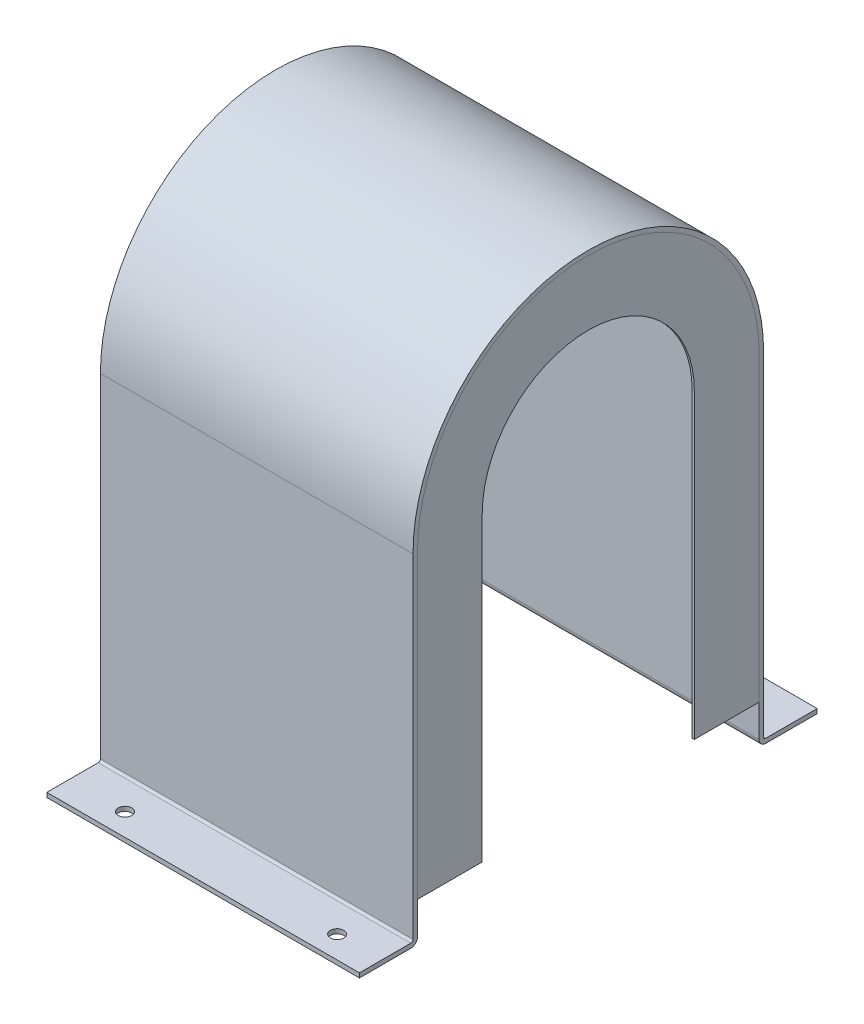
ISO-10303-21;
HEADER;
FILE_DESCRIPTION(('STEP AP214'),'2;1');
FILE_NAME('part.step','',(''),(''),'','','');
FILE_SCHEMA(('AUTOMOTIVE_DESIGN { 1 0 10303 214 1 1 1 1 }'));
ENDSEC;
DATA;
#1=APPLICATION_CONTEXT('core data for automotive mechanical design processes');
#2=APPLICATION_PROTOCOL_DEFINITION('international standard','automotive_design',2000,#1);
#3=PRODUCT_CONTEXT('',#1,'mechanical');
#4=PRODUCT('Part','Part','',(#3));
#5=PRODUCT_RELATED_PRODUCT_CATEGORY('part','',(#4));
#6=PRODUCT_DEFINITION_FORMATION('','',#4);
#7=PRODUCT_DEFINITION_CONTEXT('part definition',#1,'design');
#8=PRODUCT_DEFINITION('design','',#6,#7);
#9=PRODUCT_DEFINITION_SHAPE('','',#8);
#10=(LENGTH_UNIT() NAMED_UNIT(*) SI_UNIT(.MILLI.,.METRE.));
#11=(NAMED_UNIT(*) PLANE_ANGLE_UNIT() SI_UNIT($,.RADIAN.));
#12=(NAMED_UNIT(*) SI_UNIT($,.STERADIAN.) SOLID_ANGLE_UNIT());
#13=UNCERTAINTY_MEASURE_WITH_UNIT(LENGTH_MEASURE(1.E-05),#10,'distance_accuracy_value','');
#14=(GEOMETRIC_REPRESENTATION_CONTEXT(3) GLOBAL_UNCERTAINTY_ASSIGNED_CONTEXT((#13)) GLOBAL_UNIT_ASSIGNED_CONTEXT((#10,
#11,#12)) REPRESENTATION_CONTEXT('',''));
#15=CARTESIAN_POINT('',(0.,0.,0.));
#16=DIRECTION('',(0.,0.,1.));
#17=DIRECTION('',(1.,0.,0.));
#18=AXIS2_PLACEMENT_3D('',#15,#16,#17);
#19=CARTESIAN_POINT('',(-138.,-270.,153.));
#20=DIRECTION('',(0.,-1.,0.));
#21=DIRECTION('',(0.,0.,-1.));
#22=AXIS2_PLACEMENT_3D('',#19,#20,#21);
#23=PLANE('',#22);
#24=DIRECTION('',(-1.,0.,0.));
#25=VECTOR('',#24,1.);
#26=CARTESIAN_POINT('',(140.,-270.,95.));
#27=LINE('',#26,#25);
#28=CARTESIAN_POINT('',(-138.,-270.,95.));
#29=VERTEX_POINT('',#28);
#30=CARTESIAN_POINT('',(-140.,-270.,95.));
#31=VERTEX_POINT('',#30);
#32=EDGE_CURVE('E186',#29,#31,#27,.T.);
#33=ORIENTED_EDGE('',*,*,#32,.F.);
#34=DIRECTION('',(0.,0.,-1.));
#35=VECTOR('',#34,1.);
#36=CARTESIAN_POINT('',(-138.,-270.,153.));
#37=LINE('',#36,#35);
#38=CARTESIAN_POINT('',(-138.,-270.,153.));
#39=VERTEX_POINT('',#38);
#40=EDGE_CURVE('E150',#39,#29,#37,.T.);
#41=ORIENTED_EDGE('',*,*,#40,.F.);
#42=DIRECTION('',(-1.,0.,0.));
#43=VECTOR('',#42,1.);
#44=CARTESIAN_POINT('',(-138.,-270.,153.));
#45=LINE('',#44,#43);
#46=CARTESIAN_POINT('',(-140.,-270.,153.));
#47=VERTEX_POINT('',#46);
#48=EDGE_CURVE('E158',#39,#47,#45,.T.);
#49=ORIENTED_EDGE('',*,*,#48,.T.);
#50=DIRECTION('',(0.,0.,-1.));
#51=VECTOR('',#50,1.);
#52=CARTESIAN_POINT('',(-140.,-270.,153.));
#53=LINE('',#52,#51);
#54=EDGE_CURVE('E161',#47,#31,#53,.T.);
#55=ORIENTED_EDGE('',*,*,#54,.T.);
#56=EDGE_LOOP('',(#33,#41,#49,#55));
#57=FACE_BOUND('',#56,.T.);
#58=ADVANCED_FACE('F59',(#57),#23,.T.);
#59=CARTESIAN_POINT('',(-138.,0.,0.));
#60=DIRECTION('',(-1.,0.,0.));
#61=DIRECTION('',(0.,0.,-1.));
#62=AXIS2_PLACEMENT_3D('',#59,#60,#61);
#63=CYLINDRICAL_SURFACE('',#62,95.);
#64=DIRECTION('',(-1.,0.,0.));
#65=VECTOR('',#64,1.);
#66=CARTESIAN_POINT('',(-138.,0.,95.));
#67=LINE('',#66,#65);
#68=CARTESIAN_POINT('',(-140.,0.,95.));
#69=VERTEX_POINT('',#68);
#70=CARTESIAN_POINT('',(-138.,0.,95.));
#71=VERTEX_POINT('',#70);
#72=EDGE_CURVE('E13',#69,#71,#67,.F.);
#73=ORIENTED_EDGE('',*,*,#72,.F.);
#74=CARTESIAN_POINT('',(-140.,0.,0.));
#75=DIRECTION('',(1.,0.,0.));
#76=DIRECTION('',(0.,0.,-1.));
#77=AXIS2_PLACEMENT_3D('',#74,#75,#76);
#78=CIRCLE('',#77,95.);
#79=CARTESIAN_POINT('',(-140.,0.,-95.));
#80=VERTEX_POINT('',#79);
#81=EDGE_CURVE('E133',#80,#69,#78,.T.);
#82=ORIENTED_EDGE('',*,*,#81,.F.);
#83=DIRECTION('',(-1.,0.,0.));
#84=VECTOR('',#83,1.);
#85=CARTESIAN_POINT('',(-138.,0.,-95.));
#86=LINE('',#85,#84);
#87=CARTESIAN_POINT('',(-138.,0.,-95.));
#88=VERTEX_POINT('',#87);
#89=EDGE_CURVE('E67',#80,#88,#86,.F.);
#90=ORIENTED_EDGE('',*,*,#89,.T.);
#91=CARTESIAN_POINT('',(-138.,0.,0.));
#92=DIRECTION('',(1.,0.,0.));
#93=DIRECTION('',(0.,0.,-1.));
#94=AXIS2_PLACEMENT_3D('',#91,#92,#93);
#95=CIRCLE('',#94,95.);
#96=EDGE_CURVE('E138',#88,#71,#95,.T.);
#97=ORIENTED_EDGE('',*,*,#96,.T.);
#98=EDGE_LOOP('',(#73,#82,#90,#97));
#99=FACE_BOUND('',#98,.T.);
#100=ADVANCED_FACE('F137',(#99),#63,.F.);
#101=CARTESIAN_POINT('',(-138.,0.,153.));
#102=DIRECTION('',(0.,0.,1.));
#103=DIRECTION('',(-1.,0.,0.));
#104=AXIS2_PLACEMENT_3D('',#101,#102,#103);
#105=PLANE('',#104);
#106=DIRECTION('',(0.,-1.,0.));
#107=VECTOR('',#106,1.);
#108=CARTESIAN_POINT('',(-140.,0.,153.));
#109=LINE('',#108,#107);
#110=CARTESIAN_POINT('',(-140.,0.,153.));
#111=VERTEX_POINT('',#110);
#112=EDGE_CURVE('E141',#111,#47,#109,.T.);
#113=ORIENTED_EDGE('',*,*,#112,.T.);
#114=ORIENTED_EDGE('',*,*,#48,.F.);
#115=DIRECTION('',(0.,-1.,0.));
#116=VECTOR('',#115,1.);
#117=CARTESIAN_POINT('',(-138.,0.,153.));
#118=LINE('',#117,#116);
#119=CARTESIAN_POINT('',(-138.,0.,153.));
#120=VERTEX_POINT('',#119);
#121=EDGE_CURVE('E145',#120,#39,#118,.T.);
#122=ORIENTED_EDGE('',*,*,#121,.F.);
#123=DIRECTION('',(-1.,0.,0.));
#124=VECTOR('',#123,1.);
#125=CARTESIAN_POINT('',(-138.,0.,153.));
#126=LINE('',#125,#124);
#127=EDGE_CURVE('E128',#120,#111,#126,.T.);
#128=ORIENTED_EDGE('',*,*,#127,.T.);
#129=EDGE_LOOP('',(#113,#114,#122,#128));
#130=FACE_BOUND('',#129,.T.);
#131=ADVANCED_FACE('F61',(#130),#105,.T.);
#132=CARTESIAN_POINT('',(-138.,0.,0.));
#133=DIRECTION('',(-1.,0.,0.));
#134=DIRECTION('',(0.,0.,-1.));
#135=AXIS2_PLACEMENT_3D('',#132,#133,#134);
#136=CYLINDRICAL_SURFACE('',#135,153.);
#137=CARTESIAN_POINT('',(-140.,0.,0.));
#138=DIRECTION('',(-1.,0.,0.));
#139=DIRECTION('',(0.,0.,1.));
#140=AXIS2_PLACEMENT_3D('',#137,#138,#139);
#141=CIRCLE('',#140,153.);
#142=CARTESIAN_POINT('',(-140.,0.,-153.));
#143=VERTEX_POINT('',#142);
#144=EDGE_CURVE('E149',#111,#143,#141,.T.);
#145=ORIENTED_EDGE('',*,*,#144,.F.);
#146=ORIENTED_EDGE('',*,*,#127,.F.);
#147=CARTESIAN_POINT('',(-138.,0.,0.));
#148=DIRECTION('',(-1.,0.,0.));
#149=DIRECTION('',(0.,0.,1.));
#150=AXIS2_PLACEMENT_3D('',#147,#148,#149);
#151=CIRCLE('',#150,153.);
#152=CARTESIAN_POINT('',(-138.,0.,-153.));
#153=VERTEX_POINT('',#152);
#154=EDGE_CURVE('E155',#120,#153,#151,.T.);
#155=ORIENTED_EDGE('',*,*,#154,.T.);
#156=DIRECTION('',(-1.,0.,0.));
#157=VECTOR('',#156,1.);
#158=CARTESIAN_POINT('',(-138.,0.,-153.));
#159=LINE('',#158,#157);
#160=EDGE_CURVE('E170',#153,#143,#159,.T.);
#161=ORIENTED_EDGE('',*,*,#160,.T.);
#162=EDGE_LOOP('',(#145,#146,#155,#161));
#163=FACE_BOUND('',#162,.T.);
#164=ADVANCED_FACE('F197',(#163),#136,.T.);
#165=CARTESIAN_POINT('',(-138.,-270.,-153.));
#166=DIRECTION('',(0.,0.,-1.));
#167=DIRECTION('',(0.,1.,0.));
#168=AXIS2_PLACEMENT_3D('',#165,#166,#167);
#169=PLANE('',#168);
#170=DIRECTION('',(0.,1.,0.));
#171=VECTOR('',#170,1.);
#172=CARTESIAN_POINT('',(-140.,-270.,-153.));
#173=LINE('',#172,#171);
#174=CARTESIAN_POINT('',(-140.,-270.,-153.));
#175=VERTEX_POINT('',#174);
#176=EDGE_CURVE('E164',#175,#143,#173,.T.);
#177=ORIENTED_EDGE('',*,*,#176,.T.);
#178=ORIENTED_EDGE('',*,*,#160,.F.);
#179=DIRECTION('',(0.,1.,0.));
#180=VECTOR('',#179,1.);
#181=CARTESIAN_POINT('',(-138.,-270.,-153.));
#182=LINE('',#181,#180);
#183=CARTESIAN_POINT('',(-138.,-270.,-153.));
#184=VERTEX_POINT('',#183);
#185=EDGE_CURVE('E153',#184,#153,#182,.T.);
#186=ORIENTED_EDGE('',*,*,#185,.F.);
#187=DIRECTION('',(-1.,0.,0.));
#188=VECTOR('',#187,1.);
#189=CARTESIAN_POINT('',(-138.,-270.,-153.));
#190=LINE('',#189,#188);
#191=EDGE_CURVE('E173',#184,#175,#190,.T.);
#192=ORIENTED_EDGE('',*,*,#191,.T.);
#193=EDGE_LOOP('',(#177,#178,#186,#192));
#194=FACE_BOUND('',#193,.T.);
#195=ADVANCED_FACE('F199',(#194),#169,.T.);
#196=DIRECTION('',(-1.,0.,0.));
#197=VECTOR('',#196,1.);
#198=CARTESIAN_POINT('',(140.,-270.,-95.));
#199=LINE('',#198,#197);
#200=CARTESIAN_POINT('',(-138.,-270.,-95.));
#201=VERTEX_POINT('',#200);
#202=CARTESIAN_POINT('',(-140.,-270.,-95.));
#203=VERTEX_POINT('',#202);
#204=EDGE_CURVE('E184',#201,#203,#199,.T.);
#205=ORIENTED_EDGE('',*,*,#204,.T.);
#206=EDGE_CURVE('E135',#203,#175,#53,.T.);
#207=ORIENTED_EDGE('',*,*,#206,.T.);
#208=ORIENTED_EDGE('',*,*,#191,.F.);
#209=EDGE_CURVE('E148',#201,#184,#37,.T.);
#210=ORIENTED_EDGE('',*,*,#209,.F.);
#211=EDGE_LOOP('',(#205,#207,#208,#210));
#212=FACE_BOUND('',#211,.T.);
#213=ADVANCED_FACE('F203',(#212),#23,.T.);
#214=CARTESIAN_POINT('',(-138.,0.,0.));
#215=DIRECTION('',(1.,0.,0.));
#216=DIRECTION('',(0.,0.,1.));
#217=AXIS2_PLACEMENT_3D('',#214,#215,#216);
#218=PLANE('',#217);
#219=DIRECTION('',(0.,-1.,0.));
#220=VECTOR('',#219,1.);
#221=CARTESIAN_POINT('',(-138.,0.,95.));
#222=LINE('',#221,#220);
#223=EDGE_CURVE('E139',#71,#29,#222,.T.);
#224=ORIENTED_EDGE('',*,*,#223,.F.);
#225=ORIENTED_EDGE('',*,*,#96,.F.);
#226=DIRECTION('',(0.,1.,0.));
#227=VECTOR('',#226,1.);
#228=CARTESIAN_POINT('',(-138.,0.,-95.));
#229=LINE('',#228,#227);
#230=EDGE_CURVE('E81',#201,#88,#229,.T.);
#231=ORIENTED_EDGE('',*,*,#230,.F.);
#232=ORIENTED_EDGE('',*,*,#209,.T.);
#233=ORIENTED_EDGE('',*,*,#185,.T.);
#234=ORIENTED_EDGE('',*,*,#154,.F.);
#235=ORIENTED_EDGE('',*,*,#121,.T.);
#236=ORIENTED_EDGE('',*,*,#40,.T.);
#237=EDGE_LOOP('',(#224,#225,#231,#232,#233,#234,#235,#236));
#238=FACE_BOUND('',#237,.T.);
#239=ADVANCED_FACE('F193',(#238),#218,.T.);
#240=CARTESIAN_POINT('',(-140.,0.,0.));
#241=DIRECTION('',(1.,0.,0.));
#242=DIRECTION('',(0.,0.,1.));
#243=AXIS2_PLACEMENT_3D('',#240,#241,#242);
#244=PLANE('',#243);
#245=ORIENTED_EDGE('',*,*,#81,.T.);
#246=DIRECTION('',(0.,1.,0.));
#247=VECTOR('',#246,1.);
#248=CARTESIAN_POINT('',(-140.,0.,95.));
#249=LINE('',#248,#247);
#250=EDGE_CURVE('E73',#31,#69,#249,.T.);
#251=ORIENTED_EDGE('',*,*,#250,.F.);
#252=ORIENTED_EDGE('',*,*,#54,.F.);
#253=ORIENTED_EDGE('',*,*,#112,.F.);
#254=ORIENTED_EDGE('',*,*,#144,.T.);
#255=ORIENTED_EDGE('',*,*,#176,.F.);
#256=ORIENTED_EDGE('',*,*,#206,.F.);
#257=DIRECTION('',(0.,-1.,0.));
#258=VECTOR('',#257,1.);
#259=CARTESIAN_POINT('',(-140.,-270.,-95.));
#260=LINE('',#259,#258);
#261=EDGE_CURVE('E122',#80,#203,#260,.T.);
#262=ORIENTED_EDGE('',*,*,#261,.F.);
#263=EDGE_LOOP('',(#245,#251,#252,#253,#254,#255,#256,#262));
#264=FACE_BOUND('',#263,.T.);
#265=ADVANCED_FACE('F132',(#264),#244,.F.);
#266=CARTESIAN_POINT('',(140.,-270.,-95.));
#267=DIRECTION('',(0.,0.,-1.));
#268=DIRECTION('',(-1.,0.,0.));
#269=AXIS2_PLACEMENT_3D('',#266,#267,#268);
#270=PLANE('',#269);
#271=ORIENTED_EDGE('',*,*,#230,.T.);
#272=ORIENTED_EDGE('',*,*,#89,.F.);
#273=ORIENTED_EDGE('',*,*,#261,.T.);
#274=ORIENTED_EDGE('',*,*,#204,.F.);
#275=EDGE_LOOP('',(#271,#272,#273,#274));
#276=FACE_BOUND('',#275,.T.);
#277=ADVANCED_FACE('F121',(#276),#270,.F.);
#278=CARTESIAN_POINT('',(140.,0.,95.));
#279=DIRECTION('',(0.,0.,1.));
#280=DIRECTION('',(1.,0.,0.));
#281=AXIS2_PLACEMENT_3D('',#278,#279,#280);
#282=PLANE('',#281);
#283=ORIENTED_EDGE('',*,*,#223,.T.);
#284=ORIENTED_EDGE('',*,*,#32,.T.);
#285=ORIENTED_EDGE('',*,*,#250,.T.);
#286=ORIENTED_EDGE('',*,*,#72,.T.);
#287=EDGE_LOOP('',(#283,#284,#285,#286));
#288=FACE_BOUND('',#287,.T.);
#289=ADVANCED_FACE('F190',(#288),#282,.F.);
#290=CLOSED_SHELL('',(#58,#100,#131,#164,#195,#213,#239,#265,#277,#289));
#291=MANIFOLD_SOLID_BREP('B2',#290);
#292=CARTESIAN_POINT('',(138.,-270.,153.));
#293=DIRECTION('',(0.,-1.,0.));
#294=DIRECTION('',(0.,0.,-1.));
#295=AXIS2_PLACEMENT_3D('',#292,#293,#294);
#296=PLANE('',#295);
#297=DIRECTION('',(-1.,0.,0.));
#298=VECTOR('',#297,1.);
#299=CARTESIAN_POINT('',(140.,-270.,95.));
#300=LINE('',#299,#298);
#301=CARTESIAN_POINT('',(140.,-270.,95.));
#302=VERTEX_POINT('',#301);
#303=CARTESIAN_POINT('',(138.,-270.,95.));
#304=VERTEX_POINT('',#303);
#305=EDGE_CURVE('E364',#302,#304,#300,.T.);
#306=ORIENTED_EDGE('',*,*,#305,.F.);
#307=DIRECTION('',(0.,0.,-1.));
#308=VECTOR('',#307,1.);
#309=CARTESIAN_POINT('',(140.,-270.,153.));
#310=LINE('',#309,#308);
#311=CARTESIAN_POINT('',(140.,-270.,153.));
#312=VERTEX_POINT('',#311);
#313=EDGE_CURVE('E383',#312,#302,#310,.T.);
#314=ORIENTED_EDGE('',*,*,#313,.F.);
#315=DIRECTION('',(1.,0.,0.));
#316=VECTOR('',#315,1.);
#317=CARTESIAN_POINT('',(138.,-270.,153.));
#318=LINE('',#317,#316);
#319=CARTESIAN_POINT('',(138.,-270.,153.));
#320=VERTEX_POINT('',#319);
#321=EDGE_CURVE('E297',#320,#312,#318,.T.);
#322=ORIENTED_EDGE('',*,*,#321,.F.);
#323=DIRECTION('',(0.,0.,-1.));
#324=VECTOR('',#323,1.);
#325=CARTESIAN_POINT('',(138.,-270.,153.));
#326=LINE('',#325,#324);
#327=EDGE_CURVE('E409',#320,#304,#326,.T.);
#328=ORIENTED_EDGE('',*,*,#327,.T.);
#329=EDGE_LOOP('',(#306,#314,#322,#328));
#330=FACE_BOUND('',#329,.T.);
#331=ADVANCED_FACE('F293',(#330),#296,.T.);
#332=CARTESIAN_POINT('',(138.,0.,153.));
#333=DIRECTION('',(0.,0.,1.));
#334=DIRECTION('',(1.,0.,0.));
#335=AXIS2_PLACEMENT_3D('',#332,#333,#334);
#336=PLANE('',#335);
#337=DIRECTION('',(0.,-1.,0.));
#338=VECTOR('',#337,1.);
#339=CARTESIAN_POINT('',(140.,0.,153.));
#340=LINE('',#339,#338);
#341=CARTESIAN_POINT('',(140.,0.,153.));
#342=VERTEX_POINT('',#341);
#343=EDGE_CURVE('E384',#342,#312,#340,.T.);
#344=ORIENTED_EDGE('',*,*,#343,.F.);
#345=DIRECTION('',(1.,0.,0.));
#346=VECTOR('',#345,1.);
#347=CARTESIAN_POINT('',(138.,0.,153.));
#348=LINE('',#347,#346);
#349=CARTESIAN_POINT('',(138.,0.,153.));
#350=VERTEX_POINT('',#349);
#351=EDGE_CURVE('E57',#350,#342,#348,.T.);
#352=ORIENTED_EDGE('',*,*,#351,.F.);
#353=DIRECTION('',(0.,-1.,0.));
#354=VECTOR('',#353,1.);
#355=CARTESIAN_POINT('',(138.,0.,153.));
#356=LINE('',#355,#354);
#357=EDGE_CURVE('E395',#350,#320,#356,.T.);
#358=ORIENTED_EDGE('',*,*,#357,.T.);
#359=ORIENTED_EDGE('',*,*,#321,.T.);
#360=EDGE_LOOP('',(#344,#352,#358,#359));
#361=FACE_BOUND('',#360,.T.);
#362=ADVANCED_FACE('F295',(#361),#336,.T.);
#363=CARTESIAN_POINT('',(138.,0.,0.));
#364=DIRECTION('',(1.,0.,0.));
#365=DIRECTION('',(0.,0.,-1.));
#366=AXIS2_PLACEMENT_3D('',#363,#364,#365);
#367=CYLINDRICAL_SURFACE('',#366,153.);
#368=CARTESIAN_POINT('',(140.,0.,0.));
#369=DIRECTION('',(-1.,0.,0.));
#370=DIRECTION('',(0.,0.,1.));
#371=AXIS2_PLACEMENT_3D('',#368,#369,#370);
#372=CIRCLE('',#371,153.);
#373=CARTESIAN_POINT('',(140.,0.,-153.));
#374=VERTEX_POINT('',#373);
#375=EDGE_CURVE('E393',#342,#374,#372,.T.);
#376=ORIENTED_EDGE('',*,*,#375,.T.);
#377=DIRECTION('',(1.,0.,0.));
#378=VECTOR('',#377,1.);
#379=CARTESIAN_POINT('',(138.,0.,-153.));
#380=LINE('',#379,#378);
#381=CARTESIAN_POINT('',(138.,0.,-153.));
#382=VERTEX_POINT('',#381);
#383=EDGE_CURVE('E302',#382,#374,#380,.T.);
#384=ORIENTED_EDGE('',*,*,#383,.F.);
#385=CARTESIAN_POINT('',(138.,0.,0.));
#386=DIRECTION('',(-1.,0.,0.));
#387=DIRECTION('',(0.,0.,1.));
#388=AXIS2_PLACEMENT_3D('',#385,#386,#387);
#389=CIRCLE('',#388,153.);
#390=EDGE_CURVE('E397',#350,#382,#389,.T.);
#391=ORIENTED_EDGE('',*,*,#390,.F.);
#392=ORIENTED_EDGE('',*,*,#351,.T.);
#393=EDGE_LOOP('',(#376,#384,#391,#392));
#394=FACE_BOUND('',#393,.T.);
#395=ADVANCED_FACE('F434',(#394),#367,.T.);
#396=CARTESIAN_POINT('',(138.,-270.,-153.));
#397=DIRECTION('',(0.,0.,-1.));
#398=DIRECTION('',(0.,1.,0.));
#399=AXIS2_PLACEMENT_3D('',#396,#397,#398);
#400=PLANE('',#399);
#401=DIRECTION('',(0.,1.,0.));
#402=VECTOR('',#401,1.);
#403=CARTESIAN_POINT('',(140.,-270.,-153.));
#404=LINE('',#403,#402);
#405=CARTESIAN_POINT('',(140.,-270.,-153.));
#406=VERTEX_POINT('',#405);
#407=EDGE_CURVE('E386',#406,#374,#404,.T.);
#408=ORIENTED_EDGE('',*,*,#407,.F.);
#409=DIRECTION('',(1.,0.,0.));
#410=VECTOR('',#409,1.);
#411=CARTESIAN_POINT('',(138.,-270.,-153.));
#412=LINE('',#411,#410);
#413=CARTESIAN_POINT('',(138.,-270.,-153.));
#414=VERTEX_POINT('',#413);
#415=EDGE_CURVE('E381',#414,#406,#412,.T.);
#416=ORIENTED_EDGE('',*,*,#415,.F.);
#417=DIRECTION('',(0.,1.,0.));
#418=VECTOR('',#417,1.);
#419=CARTESIAN_POINT('',(138.,-270.,-153.));
#420=LINE('',#419,#418);
#421=EDGE_CURVE('E402',#414,#382,#420,.T.);
#422=ORIENTED_EDGE('',*,*,#421,.T.);
#423=ORIENTED_EDGE('',*,*,#383,.T.);
#424=EDGE_LOOP('',(#408,#416,#422,#423));
#425=FACE_BOUND('',#424,.T.);
#426=ADVANCED_FACE('F431',(#425),#400,.T.);
#427=DIRECTION('',(-1.,0.,0.));
#428=VECTOR('',#427,1.);
#429=CARTESIAN_POINT('',(140.,-270.,-95.));
#430=LINE('',#429,#428);
#431=CARTESIAN_POINT('',(140.,-270.,-95.));
#432=VERTEX_POINT('',#431);
#433=CARTESIAN_POINT('',(138.,-270.,-95.));
#434=VERTEX_POINT('',#433);
#435=EDGE_CURVE('E357',#432,#434,#430,.T.);
#436=ORIENTED_EDGE('',*,*,#435,.T.);
#437=EDGE_CURVE('E414',#434,#414,#326,.T.);
#438=ORIENTED_EDGE('',*,*,#437,.T.);
#439=ORIENTED_EDGE('',*,*,#415,.T.);
#440=EDGE_CURVE('E372',#432,#406,#310,.T.);
#441=ORIENTED_EDGE('',*,*,#440,.F.);
#442=EDGE_LOOP('',(#436,#438,#439,#441));
#443=FACE_BOUND('',#442,.T.);
#444=ADVANCED_FACE('F379',(#443),#296,.T.);
#445=CARTESIAN_POINT('',(138.,0.,0.));
#446=DIRECTION('',(-1.,0.,0.));
#447=DIRECTION('',(0.,0.,1.));
#448=AXIS2_PLACEMENT_3D('',#445,#446,#447);
#449=PLANE('',#448);
#450=DIRECTION('',(0.,1.,0.));
#451=VECTOR('',#450,1.);
#452=CARTESIAN_POINT('',(138.,0.,95.));
#453=LINE('',#452,#451);
#454=CARTESIAN_POINT('',(138.,0.,95.));
#455=VERTEX_POINT('',#454);
#456=EDGE_CURVE('E318',#304,#455,#453,.T.);
#457=ORIENTED_EDGE('',*,*,#456,.F.);
#458=ORIENTED_EDGE('',*,*,#327,.F.);
#459=ORIENTED_EDGE('',*,*,#357,.F.);
#460=ORIENTED_EDGE('',*,*,#390,.T.);
#461=ORIENTED_EDGE('',*,*,#421,.F.);
#462=ORIENTED_EDGE('',*,*,#437,.F.);
#463=DIRECTION('',(0.,-1.,0.));
#464=VECTOR('',#463,1.);
#465=CARTESIAN_POINT('',(138.,0.,-95.));
#466=LINE('',#465,#464);
#467=CARTESIAN_POINT('',(138.,0.,-95.));
#468=VERTEX_POINT('',#467);
#469=EDGE_CURVE('E360',#468,#434,#466,.T.);
#470=ORIENTED_EDGE('',*,*,#469,.F.);
#471=CARTESIAN_POINT('',(138.,0.,0.));
#472=DIRECTION('',(1.,0.,0.));
#473=DIRECTION('',(0.,0.,-1.));
#474=AXIS2_PLACEMENT_3D('',#471,#472,#473);
#475=CIRCLE('',#474,95.);
#476=EDGE_CURVE('E388',#468,#455,#475,.T.);
#477=ORIENTED_EDGE('',*,*,#476,.T.);
#478=EDGE_LOOP('',(#457,#458,#459,#460,#461,#462,#470,#477));
#479=FACE_BOUND('',#478,.T.);
#480=ADVANCED_FACE('F429',(#479),#449,.T.);
#481=CARTESIAN_POINT('',(140.,0.,0.));
#482=DIRECTION('',(-1.,0.,0.));
#483=DIRECTION('',(0.,0.,1.));
#484=AXIS2_PLACEMENT_3D('',#481,#482,#483);
#485=PLANE('',#484);
#486=ORIENTED_EDGE('',*,*,#313,.T.);
#487=DIRECTION('',(0.,1.,0.));
#488=VECTOR('',#487,1.);
#489=CARTESIAN_POINT('',(140.,0.,95.));
#490=LINE('',#489,#488);
#491=CARTESIAN_POINT('',(140.,0.,95.));
#492=VERTEX_POINT('',#491);
#493=EDGE_CURVE('E377',#302,#492,#490,.T.);
#494=ORIENTED_EDGE('',*,*,#493,.T.);
#495=CARTESIAN_POINT('',(140.,0.,0.));
#496=DIRECTION('',(1.,0.,0.));
#497=DIRECTION('',(0.,0.,-1.));
#498=AXIS2_PLACEMENT_3D('',#495,#496,#497);
#499=CIRCLE('',#498,95.);
#500=CARTESIAN_POINT('',(140.,0.,-95.));
#501=VERTEX_POINT('',#500);
#502=EDGE_CURVE('E376',#501,#492,#499,.T.);
#503=ORIENTED_EDGE('',*,*,#502,.F.);
#504=DIRECTION('',(0.,-1.,0.));
#505=VECTOR('',#504,1.);
#506=CARTESIAN_POINT('',(140.,-270.,-95.));
#507=LINE('',#506,#505);
#508=EDGE_CURVE('E310',#501,#432,#507,.T.);
#509=ORIENTED_EDGE('',*,*,#508,.T.);
#510=ORIENTED_EDGE('',*,*,#440,.T.);
#511=ORIENTED_EDGE('',*,*,#407,.T.);
#512=ORIENTED_EDGE('',*,*,#375,.F.);
#513=ORIENTED_EDGE('',*,*,#343,.T.);
#514=EDGE_LOOP('',(#486,#494,#503,#509,#510,#511,#512,#513));
#515=FACE_BOUND('',#514,.T.);
#516=ADVANCED_FACE('F370',(#515),#485,.F.);
#517=CARTESIAN_POINT('',(138.,0.,0.));
#518=DIRECTION('',(1.,0.,0.));
#519=DIRECTION('',(0.,0.,-1.));
#520=AXIS2_PLACEMENT_3D('',#517,#518,#519);
#521=CYLINDRICAL_SURFACE('',#520,95.);
#522=ORIENTED_EDGE('',*,*,#502,.T.);
#523=DIRECTION('',(-1.,0.,0.));
#524=VECTOR('',#523,1.);
#525=CARTESIAN_POINT('',(140.,0.,95.));
#526=LINE('',#525,#524);
#527=EDGE_CURVE('E421',#492,#455,#526,.T.);
#528=ORIENTED_EDGE('',*,*,#527,.T.);
#529=ORIENTED_EDGE('',*,*,#476,.F.);
#530=DIRECTION('',(-1.,0.,0.));
#531=VECTOR('',#530,1.);
#532=CARTESIAN_POINT('',(140.,0.,-95.));
#533=LINE('',#532,#531);
#534=EDGE_CURVE('E365',#501,#468,#533,.T.);
#535=ORIENTED_EDGE('',*,*,#534,.F.);
#536=EDGE_LOOP('',(#522,#528,#529,#535));
#537=FACE_BOUND('',#536,.T.);
#538=ADVANCED_FACE('F427',(#537),#521,.F.);
#539=CARTESIAN_POINT('',(140.,-270.,-95.));
#540=DIRECTION('',(0.,0.,-1.));
#541=DIRECTION('',(-1.,0.,0.));
#542=AXIS2_PLACEMENT_3D('',#539,#540,#541);
#543=PLANE('',#542);
#544=ORIENTED_EDGE('',*,*,#469,.T.);
#545=ORIENTED_EDGE('',*,*,#435,.F.);
#546=ORIENTED_EDGE('',*,*,#508,.F.);
#547=ORIENTED_EDGE('',*,*,#534,.T.);
#548=EDGE_LOOP('',(#544,#545,#546,#547));
#549=FACE_BOUND('',#548,.T.);
#550=ADVANCED_FACE('F358',(#549),#543,.F.);
#551=CARTESIAN_POINT('',(140.,0.,95.));
#552=DIRECTION('',(0.,0.,1.));
#553=DIRECTION('',(1.,0.,0.));
#554=AXIS2_PLACEMENT_3D('',#551,#552,#553);
#555=PLANE('',#554);
#556=ORIENTED_EDGE('',*,*,#456,.T.);
#557=ORIENTED_EDGE('',*,*,#527,.F.);
#558=ORIENTED_EDGE('',*,*,#493,.F.);
#559=ORIENTED_EDGE('',*,*,#305,.T.);
#560=EDGE_LOOP('',(#556,#557,#558,#559));
#561=FACE_BOUND('',#560,.T.);
#562=ADVANCED_FACE('F437',(#561),#555,.F.);
#563=CLOSED_SHELL('',(#331,#362,#395,#426,#444,#480,#516,#538,#550,#562));
#564=MANIFOLD_SOLID_BREP('B7',#563);
#565=CARTESIAN_POINT('',(140.,0.,-157.));
#566=DIRECTION('',(0.,0.,-1.));
#567=DIRECTION('',(-1.,0.,0.));
#568=AXIS2_PLACEMENT_3D('',#565,#566,#567);
#569=PLANE('',#568);
#570=DIRECTION('',(0.,-1.,0.));
#571=VECTOR('',#570,1.);
#572=CARTESIAN_POINT('',(-140.,0.,-157.));
#573=LINE('',#572,#571);
#574=CARTESIAN_POINT('',(-140.,0.,-157.));
#575=VERTEX_POINT('',#574);
#576=CARTESIAN_POINT('',(-140.,-299.,-157.));
#577=VERTEX_POINT('',#576);
#578=EDGE_CURVE('E664',#575,#577,#573,.T.);
#579=ORIENTED_EDGE('',*,*,#578,.F.);
#580=DIRECTION('',(-1.,0.,0.));
#581=VECTOR('',#580,1.);
#582=CARTESIAN_POINT('',(140.,0.,-157.));
#583=LINE('',#582,#581);
#584=CARTESIAN_POINT('',(140.,0.,-157.));
#585=VERTEX_POINT('',#584);
#586=EDGE_CURVE('E291',#585,#575,#583,.T.);
#587=ORIENTED_EDGE('',*,*,#586,.F.);
#588=DIRECTION('',(0.,-1.,0.));
#589=VECTOR('',#588,1.);
#590=CARTESIAN_POINT('',(140.,0.,-157.));
#591=LINE('',#590,#589);
#592=CARTESIAN_POINT('',(140.,-299.,-157.));
#593=VERTEX_POINT('',#592);
#594=EDGE_CURVE('E704',#585,#593,#591,.T.);
#595=ORIENTED_EDGE('',*,*,#594,.T.);
#596=DIRECTION('',(-1.,0.,0.));
#597=VECTOR('',#596,1.);
#598=CARTESIAN_POINT('',(140.,-299.,-157.));
#599=LINE('',#598,#597);
#600=EDGE_CURVE('E521',#593,#577,#599,.T.);
#601=ORIENTED_EDGE('',*,*,#600,.T.);
#602=EDGE_LOOP('',(#579,#587,#595,#601));
#603=FACE_BOUND('',#602,.T.);
#604=ADVANCED_FACE('F518',(#603),#569,.T.);
#605=CARTESIAN_POINT('',(140.,0.,0.));
#606=DIRECTION('',(-1.,0.,0.));
#607=DIRECTION('',(0.,0.,1.));
#608=AXIS2_PLACEMENT_3D('',#605,#606,#607);
#609=CYLINDRICAL_SURFACE('',#608,157.);
#610=CARTESIAN_POINT('',(-140.,0.,0.));
#611=DIRECTION('',(1.,0.,0.));
#612=DIRECTION('',(0.,0.,-1.));
#613=AXIS2_PLACEMENT_3D('',#610,#611,#612);
#614=CIRCLE('',#613,157.);
#615=CARTESIAN_POINT('',(-140.,0.,157.));
#616=VERTEX_POINT('',#615);
#617=EDGE_CURVE('E587',#575,#616,#614,.T.);
#618=ORIENTED_EDGE('',*,*,#617,.T.);
#619=DIRECTION('',(-1.,0.,0.));
#620=VECTOR('',#619,1.);
#621=CARTESIAN_POINT('',(140.,0.,157.));
#622=LINE('',#621,#620);
#623=CARTESIAN_POINT('',(140.,0.,157.));
#624=VERTEX_POINT('',#623);
#625=EDGE_CURVE('E527',#624,#616,#622,.T.);
#626=ORIENTED_EDGE('',*,*,#625,.F.);
#627=CARTESIAN_POINT('',(140.,0.,0.));
#628=DIRECTION('',(1.,0.,0.));
#629=DIRECTION('',(0.,0.,-1.));
#630=AXIS2_PLACEMENT_3D('',#627,#628,#629);
#631=CIRCLE('',#630,157.);
#632=EDGE_CURVE('E642',#585,#624,#631,.T.);
#633=ORIENTED_EDGE('',*,*,#632,.F.);
#634=ORIENTED_EDGE('',*,*,#586,.T.);
#635=EDGE_LOOP('',(#618,#626,#633,#634));
#636=FACE_BOUND('',#635,.T.);
#637=ADVANCED_FACE('F833',(#636),#609,.T.);
#638=CARTESIAN_POINT('',(140.,0.,157.));
#639=DIRECTION('',(0.,0.,-1.));
#640=DIRECTION('',(-1.,0.,0.));
#641=AXIS2_PLACEMENT_3D('',#638,#639,#640);
#642=PLANE('',#641);
#643=DIRECTION('',(0.,-1.,0.));
#644=VECTOR('',#643,1.);
#645=CARTESIAN_POINT('',(-140.,0.,157.));
#646=LINE('',#645,#644);
#647=CARTESIAN_POINT('',(-140.,-299.,157.));
#648=VERTEX_POINT('',#647);
#649=EDGE_CURVE('E649',#616,#648,#646,.T.);
#650=ORIENTED_EDGE('',*,*,#649,.T.);
#651=DIRECTION('',(-1.,0.,0.));
#652=VECTOR('',#651,1.);
#653=CARTESIAN_POINT('',(140.,-299.,157.));
#654=LINE('',#653,#652);
#655=CARTESIAN_POINT('',(140.,-299.,157.));
#656=VERTEX_POINT('',#655);
#657=EDGE_CURVE('E646',#656,#648,#654,.T.);
#658=ORIENTED_EDGE('',*,*,#657,.F.);
#659=DIRECTION('',(0.,-1.,0.));
#660=VECTOR('',#659,1.);
#661=CARTESIAN_POINT('',(140.,0.,157.));
#662=LINE('',#661,#660);
#663=EDGE_CURVE('E635',#624,#656,#662,.T.);
#664=ORIENTED_EDGE('',*,*,#663,.F.);
#665=ORIENTED_EDGE('',*,*,#625,.T.);
#666=EDGE_LOOP('',(#650,#658,#664,#665));
#667=FACE_BOUND('',#666,.T.);
#668=ADVANCED_FACE('F647',(#667),#642,.F.);
#669=CARTESIAN_POINT('',(140.,-299.,159.));
#670=DIRECTION('',(-1.,0.,0.));
#671=DIRECTION('',(0.,0.,1.));
#672=AXIS2_PLACEMENT_3D('',#669,#670,#671);
#673=CYLINDRICAL_SURFACE('',#672,2.00000000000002);
#674=CARTESIAN_POINT('',(-140.,-299.,159.));
#675=DIRECTION('',(-1.,0.,0.));
#676=DIRECTION('',(0.,0.,1.));
#677=AXIS2_PLACEMENT_3D('',#674,#675,#676);
#678=CIRCLE('',#677,2.00000000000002);
#679=CARTESIAN_POINT('',(-140.,-301.,159.));
#680=VERTEX_POINT('',#679);
#681=EDGE_CURVE('E701',#648,#680,#678,.T.);
#682=ORIENTED_EDGE('',*,*,#681,.T.);
#683=DIRECTION('',(-1.,0.,0.));
#684=VECTOR('',#683,1.);
#685=CARTESIAN_POINT('',(140.,-301.,159.));
#686=LINE('',#685,#684);
#687=CARTESIAN_POINT('',(140.,-301.,159.));
#688=VERTEX_POINT('',#687);
#689=EDGE_CURVE('E652',#688,#680,#686,.T.);
#690=ORIENTED_EDGE('',*,*,#689,.F.);
#691=CARTESIAN_POINT('',(140.,-299.,159.));
#692=DIRECTION('',(-1.,0.,0.));
#693=DIRECTION('',(0.,0.,1.));
#694=AXIS2_PLACEMENT_3D('',#691,#692,#693);
#695=CIRCLE('',#694,2.00000000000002);
#696=EDGE_CURVE('E640',#656,#688,#695,.T.);
#697=ORIENTED_EDGE('',*,*,#696,.F.);
#698=ORIENTED_EDGE('',*,*,#657,.T.);
#699=EDGE_LOOP('',(#682,#690,#697,#698));
#700=FACE_BOUND('',#699,.T.);
#701=ADVANCED_FACE('F654',(#700),#673,.F.);
#702=CARTESIAN_POINT('',(140.,-301.,159.));
#703=DIRECTION('',(0.,-1.,0.));
#704=DIRECTION('',(0.,0.,-1.));
#705=AXIS2_PLACEMENT_3D('',#702,#703,#704);
#706=PLANE('',#705);
#707=CARTESIAN_POINT('',(100.,-301.,185.));
#708=DIRECTION('',(0.,1.,0.));
#709=DIRECTION('',(0.,0.,1.));
#710=AXIS2_PLACEMENT_3D('',#707,#708,#709);
#711=CIRCLE('',#710,6.);
#712=CARTESIAN_POINT('',(100.,-301.,191.));
#713=VERTEX_POINT('',#712);
#714=EDGE_CURVE('E783',#713,#713,#711,.T.);
#715=ORIENTED_EDGE('',*,*,#714,.F.);
#716=EDGE_LOOP('',(#715));
#717=FACE_BOUND('',#716,.T.);
#718=CARTESIAN_POINT('',(-90.,-301.,185.));
#719=DIRECTION('',(0.,1.,0.));
#720=DIRECTION('',(0.,0.,1.));
#721=AXIS2_PLACEMENT_3D('',#718,#719,#720);
#722=CIRCLE('',#721,6.);
#723=CARTESIAN_POINT('',(-90.,-301.,191.));
#724=VERTEX_POINT('',#723);
#725=EDGE_CURVE('E777',#724,#724,#722,.T.);
#726=ORIENTED_EDGE('',*,*,#725,.F.);
#727=EDGE_LOOP('',(#726));
#728=FACE_BOUND('',#727,.T.);
#729=DIRECTION('',(0.,0.,1.));
#730=VECTOR('',#729,1.);
#731=CARTESIAN_POINT('',(-140.,-301.,159.));
#732=LINE('',#731,#730);
#733=CARTESIAN_POINT('',(-140.,-301.,205.));
#734=VERTEX_POINT('',#733);
#735=EDGE_CURVE('E699',#680,#734,#732,.T.);
#736=ORIENTED_EDGE('',*,*,#735,.T.);
#737=DIRECTION('',(-1.,0.,0.));
#738=VECTOR('',#737,1.);
#739=CARTESIAN_POINT('',(140.,-301.,205.));
#740=LINE('',#739,#738);
#741=CARTESIAN_POINT('',(140.,-301.,205.));
#742=VERTEX_POINT('',#741);
#743=EDGE_CURVE('E708',#742,#734,#740,.T.);
#744=ORIENTED_EDGE('',*,*,#743,.F.);
#745=DIRECTION('',(0.,0.,1.));
#746=VECTOR('',#745,1.);
#747=CARTESIAN_POINT('',(140.,-301.,159.));
#748=LINE('',#747,#746);
#749=EDGE_CURVE('E657',#688,#742,#748,.T.);
#750=ORIENTED_EDGE('',*,*,#749,.F.);
#751=ORIENTED_EDGE('',*,*,#689,.T.);
#752=EDGE_LOOP('',(#736,#744,#750,#751));
#753=FACE_BOUND('',#752,.T.);
#754=ADVANCED_FACE('F738',(#717,#728,#753),#706,.F.);
#755=CARTESIAN_POINT('',(140.,-301.,205.));
#756=DIRECTION('',(0.,0.,-1.));
#757=DIRECTION('',(-1.,0.,0.));
#758=AXIS2_PLACEMENT_3D('',#755,#756,#757);
#759=PLANE('',#758);
#760=DIRECTION('',(0.,-1.,0.));
#761=VECTOR('',#760,1.);
#762=CARTESIAN_POINT('',(-140.,-301.,205.));
#763=LINE('',#762,#761);
#764=CARTESIAN_POINT('',(-140.,-305.,205.));
#765=VERTEX_POINT('',#764);
#766=EDGE_CURVE('E696',#734,#765,#763,.T.);
#767=ORIENTED_EDGE('',*,*,#766,.T.);
#768=DIRECTION('',(-1.,0.,0.));
#769=VECTOR('',#768,1.);
#770=CARTESIAN_POINT('',(140.,-305.,205.));
#771=LINE('',#770,#769);
#772=CARTESIAN_POINT('',(140.,-305.,205.));
#773=VERTEX_POINT('',#772);
#774=EDGE_CURVE('E711',#773,#765,#771,.T.);
#775=ORIENTED_EDGE('',*,*,#774,.F.);
#776=DIRECTION('',(0.,-1.,0.));
#777=VECTOR('',#776,1.);
#778=CARTESIAN_POINT('',(140.,-301.,205.));
#779=LINE('',#778,#777);
#780=EDGE_CURVE('E659',#742,#773,#779,.T.);
#781=ORIENTED_EDGE('',*,*,#780,.F.);
#782=ORIENTED_EDGE('',*,*,#743,.T.);
#783=EDGE_LOOP('',(#767,#775,#781,#782));
#784=FACE_BOUND('',#783,.T.);
#785=ADVANCED_FACE('F748',(#784),#759,.F.);
#786=CARTESIAN_POINT('',(140.,-305.,159.));
#787=DIRECTION('',(0.,-1.,0.));
#788=DIRECTION('',(0.,0.,-1.));
#789=AXIS2_PLACEMENT_3D('',#786,#787,#788);
#790=PLANE('',#789);
#791=CARTESIAN_POINT('',(100.,-305.,185.));
#792=DIRECTION('',(0.,1.,0.));
#793=DIRECTION('',(0.,0.,1.));
#794=AXIS2_PLACEMENT_3D('',#791,#792,#793);
#795=CIRCLE('',#794,6.);
#796=CARTESIAN_POINT('',(100.,-305.,191.));
#797=VERTEX_POINT('',#796);
#798=EDGE_CURVE('E780',#797,#797,#795,.T.);
#799=ORIENTED_EDGE('',*,*,#798,.T.);
#800=EDGE_LOOP('',(#799));
#801=FACE_BOUND('',#800,.T.);
#802=CARTESIAN_POINT('',(-90.,-305.,185.));
#803=DIRECTION('',(0.,1.,0.));
#804=DIRECTION('',(0.,0.,1.));
#805=AXIS2_PLACEMENT_3D('',#802,#803,#804);
#806=CIRCLE('',#805,6.);
#807=CARTESIAN_POINT('',(-90.,-305.,191.));
#808=VERTEX_POINT('',#807);
#809=EDGE_CURVE('E668',#808,#808,#806,.T.);
#810=ORIENTED_EDGE('',*,*,#809,.T.);
#811=EDGE_LOOP('',(#810));
#812=FACE_BOUND('',#811,.T.);
#813=DIRECTION('',(0.,0.,1.));
#814=VECTOR('',#813,1.);
#815=CARTESIAN_POINT('',(-140.,-305.,159.));
#816=LINE('',#815,#814);
#817=CARTESIAN_POINT('',(-140.,-305.,159.));
#818=VERTEX_POINT('',#817);
#819=EDGE_CURVE('E693',#818,#765,#816,.T.);
#820=ORIENTED_EDGE('',*,*,#819,.F.);
#821=DIRECTION('',(-1.,0.,0.));
#822=VECTOR('',#821,1.);
#823=CARTESIAN_POINT('',(140.,-305.,159.));
#824=LINE('',#823,#822);
#825=CARTESIAN_POINT('',(140.,-305.,159.));
#826=VERTEX_POINT('',#825);
#827=EDGE_CURVE('E713',#826,#818,#824,.T.);
#828=ORIENTED_EDGE('',*,*,#827,.F.);
#829=DIRECTION('',(0.,0.,1.));
#830=VECTOR('',#829,1.);
#831=CARTESIAN_POINT('',(140.,-305.,159.));
#832=LINE('',#831,#830);
#833=EDGE_CURVE('E745',#826,#773,#832,.T.);
#834=ORIENTED_EDGE('',*,*,#833,.T.);
#835=ORIENTED_EDGE('',*,*,#774,.T.);
#836=EDGE_LOOP('',(#820,#828,#834,#835));
#837=FACE_BOUND('',#836,.T.);
#838=ADVANCED_FACE('F751',(#801,#812,#837),#790,.T.);
#839=CARTESIAN_POINT('',(140.,-299.,159.));
#840=DIRECTION('',(-1.,0.,0.));
#841=DIRECTION('',(0.,0.,1.));
#842=AXIS2_PLACEMENT_3D('',#839,#840,#841);
#843=CYLINDRICAL_SURFACE('',#842,6.00000000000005);
#844=CARTESIAN_POINT('',(-140.,-299.,159.));
#845=DIRECTION('',(-1.,0.,0.));
#846=DIRECTION('',(0.,0.,1.));
#847=AXIS2_PLACEMENT_3D('',#844,#845,#846);
#848=CIRCLE('',#847,6.00000000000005);
#849=CARTESIAN_POINT('',(-140.,-299.,153.));
#850=VERTEX_POINT('',#849);
#851=EDGE_CURVE('E690',#850,#818,#848,.T.);
#852=ORIENTED_EDGE('',*,*,#851,.F.);
#853=DIRECTION('',(-1.,0.,0.));
#854=VECTOR('',#853,1.);
#855=CARTESIAN_POINT('',(140.,-299.,153.));
#856=LINE('',#855,#854);
#857=CARTESIAN_POINT('',(140.,-299.,153.));
#858=VERTEX_POINT('',#857);
#859=EDGE_CURVE('E715',#858,#850,#856,.T.);
#860=ORIENTED_EDGE('',*,*,#859,.F.);
#861=CARTESIAN_POINT('',(140.,-299.,159.));
#862=DIRECTION('',(-1.,0.,0.));
#863=DIRECTION('',(0.,0.,1.));
#864=AXIS2_PLACEMENT_3D('',#861,#862,#863);
#865=CIRCLE('',#864,6.00000000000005);
#866=EDGE_CURVE('E752',#858,#826,#865,.T.);
#867=ORIENTED_EDGE('',*,*,#866,.T.);
#868=ORIENTED_EDGE('',*,*,#827,.T.);
#869=EDGE_LOOP('',(#852,#860,#867,#868));
#870=FACE_BOUND('',#869,.T.);
#871=ADVANCED_FACE('F854',(#870),#843,.T.);
#872=CARTESIAN_POINT('',(140.,0.,153.));
#873=DIRECTION('',(0.,0.,-1.));
#874=DIRECTION('',(0.,1.,0.));
#875=AXIS2_PLACEMENT_3D('',#872,#873,#874);
#876=PLANE('',#875);
#877=DIRECTION('',(0.,-1.,0.));
#878=VECTOR('',#877,1.);
#879=CARTESIAN_POINT('',(-140.,0.,153.));
#880=LINE('',#879,#878);
#881=CARTESIAN_POINT('',(-140.,0.,153.));
#882=VERTEX_POINT('',#881);
#883=EDGE_CURVE('E687',#882,#850,#880,.T.);
#884=ORIENTED_EDGE('',*,*,#883,.F.);
#885=DIRECTION('',(-1.,0.,0.));
#886=VECTOR('',#885,1.);
#887=CARTESIAN_POINT('',(140.,0.,153.));
#888=LINE('',#887,#886);
#889=CARTESIAN_POINT('',(140.,0.,153.));
#890=VERTEX_POINT('',#889);
#891=EDGE_CURVE('E717',#890,#882,#888,.T.);
#892=ORIENTED_EDGE('',*,*,#891,.F.);
#893=DIRECTION('',(0.,-1.,0.));
#894=VECTOR('',#893,1.);
#895=CARTESIAN_POINT('',(140.,0.,153.));
#896=LINE('',#895,#894);
#897=EDGE_CURVE('E754',#890,#858,#896,.T.);
#898=ORIENTED_EDGE('',*,*,#897,.T.);
#899=ORIENTED_EDGE('',*,*,#859,.T.);
#900=EDGE_LOOP('',(#884,#892,#898,#899));
#901=FACE_BOUND('',#900,.T.);
#902=ADVANCED_FACE('F858',(#901),#876,.T.);
#903=CARTESIAN_POINT('',(140.,0.,0.));
#904=DIRECTION('',(-1.,0.,0.));
#905=DIRECTION('',(0.,0.,1.));
#906=AXIS2_PLACEMENT_3D('',#903,#904,#905);
#907=CYLINDRICAL_SURFACE('',#906,153.);
#908=CARTESIAN_POINT('',(-140.,0.,0.));
#909=DIRECTION('',(1.,0.,0.));
#910=DIRECTION('',(0.,0.,-1.));
#911=AXIS2_PLACEMENT_3D('',#908,#909,#910);
#912=CIRCLE('',#911,153.);
#913=CARTESIAN_POINT('',(-140.,0.,-153.));
#914=VERTEX_POINT('',#913);
#915=EDGE_CURVE('E684',#914,#882,#912,.T.);
#916=ORIENTED_EDGE('',*,*,#915,.F.);
#917=DIRECTION('',(-1.,0.,0.));
#918=VECTOR('',#917,1.);
#919=CARTESIAN_POINT('',(140.,0.,-153.));
#920=LINE('',#919,#918);
#921=CARTESIAN_POINT('',(140.,0.,-153.));
#922=VERTEX_POINT('',#921);
#923=EDGE_CURVE('E719',#922,#914,#920,.T.);
#924=ORIENTED_EDGE('',*,*,#923,.F.);
#925=CARTESIAN_POINT('',(140.,0.,0.));
#926=DIRECTION('',(1.,0.,0.));
#927=DIRECTION('',(0.,0.,-1.));
#928=AXIS2_PLACEMENT_3D('',#925,#926,#927);
#929=CIRCLE('',#928,153.);
#930=EDGE_CURVE('E759',#922,#890,#929,.T.);
#931=ORIENTED_EDGE('',*,*,#930,.T.);
#932=ORIENTED_EDGE('',*,*,#891,.T.);
#933=EDGE_LOOP('',(#916,#924,#931,#932));
#934=FACE_BOUND('',#933,.T.);
#935=ADVANCED_FACE('F862',(#934),#907,.F.);
#936=CARTESIAN_POINT('',(140.,0.,-153.));
#937=DIRECTION('',(0.,0.,-1.));
#938=DIRECTION('',(0.,1.,0.));
#939=AXIS2_PLACEMENT_3D('',#936,#937,#938);
#940=PLANE('',#939);
#941=DIRECTION('',(0.,-1.,0.));
#942=VECTOR('',#941,1.);
#943=CARTESIAN_POINT('',(-140.,0.,-153.));
#944=LINE('',#943,#942);
#945=CARTESIAN_POINT('',(-140.,-299.,-153.));
#946=VERTEX_POINT('',#945);
#947=EDGE_CURVE('E682',#914,#946,#944,.T.);
#948=ORIENTED_EDGE('',*,*,#947,.T.);
#949=DIRECTION('',(-1.,0.,0.));
#950=VECTOR('',#949,1.);
#951=CARTESIAN_POINT('',(140.,-299.,-153.));
#952=LINE('',#951,#950);
#953=CARTESIAN_POINT('',(140.,-299.,-153.));
#954=VERTEX_POINT('',#953);
#955=EDGE_CURVE('E721',#954,#946,#952,.T.);
#956=ORIENTED_EDGE('',*,*,#955,.F.);
#957=DIRECTION('',(0.,-1.,0.));
#958=VECTOR('',#957,1.);
#959=CARTESIAN_POINT('',(140.,0.,-153.));
#960=LINE('',#959,#958);
#961=EDGE_CURVE('E762',#922,#954,#960,.T.);
#962=ORIENTED_EDGE('',*,*,#961,.F.);
#963=ORIENTED_EDGE('',*,*,#923,.T.);
#964=EDGE_LOOP('',(#948,#956,#962,#963));
#965=FACE_BOUND('',#964,.T.);
#966=ADVANCED_FACE('F866',(#965),#940,.F.);
#967=CARTESIAN_POINT('',(140.,-299.,-159.));
#968=DIRECTION('',(-1.,0.,0.));
#969=DIRECTION('',(0.,0.,1.));
#970=AXIS2_PLACEMENT_3D('',#967,#968,#969);
#971=CYLINDRICAL_SURFACE('',#970,6.00000000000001);
#972=CARTESIAN_POINT('',(-140.,-299.,-159.));
#973=DIRECTION('',(1.,0.,0.));
#974=DIRECTION('',(0.,0.,-1.));
#975=AXIS2_PLACEMENT_3D('',#972,#973,#974);
#976=CIRCLE('',#975,6.00000000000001);
#977=CARTESIAN_POINT('',(-140.,-305.,-159.));
#978=VERTEX_POINT('',#977);
#979=EDGE_CURVE('E680',#946,#978,#976,.T.);
#980=ORIENTED_EDGE('',*,*,#979,.T.);
#981=DIRECTION('',(-1.,0.,0.));
#982=VECTOR('',#981,1.);
#983=CARTESIAN_POINT('',(140.,-305.,-159.));
#984=LINE('',#983,#982);
#985=CARTESIAN_POINT('',(140.,-305.,-159.));
#986=VERTEX_POINT('',#985);
#987=EDGE_CURVE('E724',#986,#978,#984,.T.);
#988=ORIENTED_EDGE('',*,*,#987,.F.);
#989=CARTESIAN_POINT('',(140.,-299.,-159.));
#990=DIRECTION('',(1.,0.,0.));
#991=DIRECTION('',(0.,0.,-1.));
#992=AXIS2_PLACEMENT_3D('',#989,#990,#991);
#993=CIRCLE('',#992,6.00000000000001);
#994=EDGE_CURVE('E764',#954,#986,#993,.T.);
#995=ORIENTED_EDGE('',*,*,#994,.F.);
#996=ORIENTED_EDGE('',*,*,#955,.T.);
#997=EDGE_LOOP('',(#980,#988,#995,#996));
#998=FACE_BOUND('',#997,.T.);
#999=ADVANCED_FACE('F808',(#998),#971,.T.);
#1000=CARTESIAN_POINT('',(140.,-305.,-159.));
#1001=DIRECTION('',(0.,1.,0.));
#1002=DIRECTION('',(0.,0.,1.));
#1003=AXIS2_PLACEMENT_3D('',#1000,#1001,#1002);
#1004=PLANE('',#1003);
#1005=CARTESIAN_POINT('',(100.,-305.,-185.));
#1006=DIRECTION('',(0.,-1.,0.));
#1007=DIRECTION('',(0.,0.,-1.));
#1008=AXIS2_PLACEMENT_3D('',#1005,#1006,#1007);
#1009=CIRCLE('',#1008,6.);
#1010=CARTESIAN_POINT('',(100.,-305.,-191.));
#1011=VERTEX_POINT('',#1010);
#1012=EDGE_CURVE('E792',#1011,#1011,#1009,.T.);
#1013=ORIENTED_EDGE('',*,*,#1012,.F.);
#1014=EDGE_LOOP('',(#1013));
#1015=FACE_BOUND('',#1014,.T.);
#1016=CARTESIAN_POINT('',(-90.,-305.,-185.));
#1017=DIRECTION('',(0.,-1.,0.));
#1018=DIRECTION('',(0.,0.,-1.));
#1019=AXIS2_PLACEMENT_3D('',#1016,#1017,#1018);
#1020=CIRCLE('',#1019,6.);
#1021=CARTESIAN_POINT('',(-90.,-305.,-191.));
#1022=VERTEX_POINT('',#1021);
#1023=EDGE_CURVE('E786',#1022,#1022,#1020,.T.);
#1024=ORIENTED_EDGE('',*,*,#1023,.F.);
#1025=EDGE_LOOP('',(#1024));
#1026=FACE_BOUND('',#1025,.T.);
#1027=DIRECTION('',(0.,0.,-1.));
#1028=VECTOR('',#1027,1.);
#1029=CARTESIAN_POINT('',(-140.,-305.,-159.));
#1030=LINE('',#1029,#1028);
#1031=CARTESIAN_POINT('',(-140.,-305.,-205.));
#1032=VERTEX_POINT('',#1031);
#1033=EDGE_CURVE('E677',#978,#1032,#1030,.T.);
#1034=ORIENTED_EDGE('',*,*,#1033,.T.);
#1035=DIRECTION('',(-1.,0.,0.));
#1036=VECTOR('',#1035,1.);
#1037=CARTESIAN_POINT('',(140.,-305.,-205.));
#1038=LINE('',#1037,#1036);
#1039=CARTESIAN_POINT('',(140.,-305.,-205.));
#1040=VERTEX_POINT('',#1039);
#1041=EDGE_CURVE('E727',#1040,#1032,#1038,.T.);
#1042=ORIENTED_EDGE('',*,*,#1041,.F.);
#1043=DIRECTION('',(0.,0.,-1.));
#1044=VECTOR('',#1043,1.);
#1045=CARTESIAN_POINT('',(140.,-305.,-159.));
#1046=LINE('',#1045,#1044);
#1047=EDGE_CURVE('E766',#986,#1040,#1046,.T.);
#1048=ORIENTED_EDGE('',*,*,#1047,.F.);
#1049=ORIENTED_EDGE('',*,*,#987,.T.);
#1050=EDGE_LOOP('',(#1034,#1042,#1048,#1049));
#1051=FACE_BOUND('',#1050,.T.);
#1052=ADVANCED_FACE('F804',(#1015,#1026,#1051),#1004,.F.);
#1053=CARTESIAN_POINT('',(140.,-301.,-205.));
#1054=DIRECTION('',(0.,0.,-1.));
#1055=DIRECTION('',(-1.,0.,0.));
#1056=AXIS2_PLACEMENT_3D('',#1053,#1054,#1055);
#1057=PLANE('',#1056);
#1058=DIRECTION('',(0.,-1.,0.));
#1059=VECTOR('',#1058,1.);
#1060=CARTESIAN_POINT('',(-140.,-301.,-205.));
#1061=LINE('',#1060,#1059);
#1062=CARTESIAN_POINT('',(-140.,-301.,-205.));
#1063=VERTEX_POINT('',#1062);
#1064=EDGE_CURVE('E674',#1063,#1032,#1061,.T.);
#1065=ORIENTED_EDGE('',*,*,#1064,.F.);
#1066=DIRECTION('',(-1.,0.,0.));
#1067=VECTOR('',#1066,1.);
#1068=CARTESIAN_POINT('',(140.,-301.,-205.));
#1069=LINE('',#1068,#1067);
#1070=CARTESIAN_POINT('',(140.,-301.,-205.));
#1071=VERTEX_POINT('',#1070);
#1072=EDGE_CURVE('E729',#1071,#1063,#1069,.T.);
#1073=ORIENTED_EDGE('',*,*,#1072,.F.);
#1074=DIRECTION('',(0.,-1.,0.));
#1075=VECTOR('',#1074,1.);
#1076=CARTESIAN_POINT('',(140.,-301.,-205.));
#1077=LINE('',#1076,#1075);
#1078=EDGE_CURVE('E768',#1071,#1040,#1077,.T.);
#1079=ORIENTED_EDGE('',*,*,#1078,.T.);
#1080=ORIENTED_EDGE('',*,*,#1041,.T.);
#1081=EDGE_LOOP('',(#1065,#1073,#1079,#1080));
#1082=FACE_BOUND('',#1081,.T.);
#1083=ADVANCED_FACE('F807',(#1082),#1057,.T.);
#1084=CARTESIAN_POINT('',(140.,-301.,-159.));
#1085=DIRECTION('',(0.,1.,0.));
#1086=DIRECTION('',(0.,0.,1.));
#1087=AXIS2_PLACEMENT_3D('',#1084,#1085,#1086);
#1088=PLANE('',#1087);
#1089=CARTESIAN_POINT('',(100.,-301.,-185.));
#1090=DIRECTION('',(0.,-1.,0.));
#1091=DIRECTION('',(0.,0.,-1.));
#1092=AXIS2_PLACEMENT_3D('',#1089,#1090,#1091);
#1093=CIRCLE('',#1092,6.);
#1094=CARTESIAN_POINT('',(100.,-301.,-191.));
#1095=VERTEX_POINT('',#1094);
#1096=EDGE_CURVE('E795',#1095,#1095,#1093,.T.);
#1097=ORIENTED_EDGE('',*,*,#1096,.T.);
#1098=EDGE_LOOP('',(#1097));
#1099=FACE_BOUND('',#1098,.T.);
#1100=CARTESIAN_POINT('',(-90.,-301.,-185.));
#1101=DIRECTION('',(0.,-1.,0.));
#1102=DIRECTION('',(0.,0.,-1.));
#1103=AXIS2_PLACEMENT_3D('',#1100,#1101,#1102);
#1104=CIRCLE('',#1103,6.);
#1105=CARTESIAN_POINT('',(-90.,-301.,-191.));
#1106=VERTEX_POINT('',#1105);
#1107=EDGE_CURVE('E789',#1106,#1106,#1104,.T.);
#1108=ORIENTED_EDGE('',*,*,#1107,.T.);
#1109=EDGE_LOOP('',(#1108));
#1110=FACE_BOUND('',#1109,.T.);
#1111=DIRECTION('',(0.,0.,-1.));
#1112=VECTOR('',#1111,1.);
#1113=CARTESIAN_POINT('',(-140.,-301.,-159.));
#1114=LINE('',#1113,#1112);
#1115=CARTESIAN_POINT('',(-140.,-301.,-159.));
#1116=VERTEX_POINT('',#1115);
#1117=EDGE_CURVE('E671',#1116,#1063,#1114,.T.);
#1118=ORIENTED_EDGE('',*,*,#1117,.F.);
#1119=DIRECTION('',(-1.,0.,0.));
#1120=VECTOR('',#1119,1.);
#1121=CARTESIAN_POINT('',(140.,-301.,-159.));
#1122=LINE('',#1121,#1120);
#1123=CARTESIAN_POINT('',(140.,-301.,-159.));
#1124=VERTEX_POINT('',#1123);
#1125=EDGE_CURVE('E730',#1124,#1116,#1122,.T.);
#1126=ORIENTED_EDGE('',*,*,#1125,.F.);
#1127=DIRECTION('',(0.,0.,-1.));
#1128=VECTOR('',#1127,1.);
#1129=CARTESIAN_POINT('',(140.,-301.,-159.));
#1130=LINE('',#1129,#1128);
#1131=EDGE_CURVE('E771',#1124,#1071,#1130,.T.);
#1132=ORIENTED_EDGE('',*,*,#1131,.T.);
#1133=ORIENTED_EDGE('',*,*,#1072,.T.);
#1134=EDGE_LOOP('',(#1118,#1126,#1132,#1133));
#1135=FACE_BOUND('',#1134,.T.);
#1136=ADVANCED_FACE('F822',(#1099,#1110,#1135),#1088,.T.);
#1137=CARTESIAN_POINT('',(140.,-299.,-159.));
#1138=DIRECTION('',(-1.,0.,0.));
#1139=DIRECTION('',(0.,0.,1.));
#1140=AXIS2_PLACEMENT_3D('',#1137,#1138,#1139);
#1141=CYLINDRICAL_SURFACE('',#1140,2.00000000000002);
#1142=CARTESIAN_POINT('',(-140.,-299.,-159.));
#1143=DIRECTION('',(1.,0.,0.));
#1144=DIRECTION('',(0.,0.,-1.));
#1145=AXIS2_PLACEMENT_3D('',#1142,#1143,#1144);
#1146=CIRCLE('',#1145,2.00000000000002);
#1147=EDGE_CURVE('E667',#577,#1116,#1146,.T.);
#1148=ORIENTED_EDGE('',*,*,#1147,.F.);
#1149=ORIENTED_EDGE('',*,*,#600,.F.);
#1150=CARTESIAN_POINT('',(140.,-299.,-159.));
#1151=DIRECTION('',(1.,0.,0.));
#1152=DIRECTION('',(0.,0.,-1.));
#1153=AXIS2_PLACEMENT_3D('',#1150,#1151,#1152);
#1154=CIRCLE('',#1153,2.00000000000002);
#1155=EDGE_CURVE('E774',#593,#1124,#1154,.T.);
#1156=ORIENTED_EDGE('',*,*,#1155,.T.);
#1157=ORIENTED_EDGE('',*,*,#1125,.T.);
#1158=EDGE_LOOP('',(#1148,#1149,#1156,#1157));
#1159=FACE_BOUND('',#1158,.T.);
#1160=ADVANCED_FACE('F732',(#1159),#1141,.F.);
#1161=CARTESIAN_POINT('',(140.,-299.,-159.));
#1162=DIRECTION('',(1.,0.,0.));
#1163=DIRECTION('',(0.,0.,-1.));
#1164=AXIS2_PLACEMENT_3D('',#1161,#1162,#1163);
#1165=PLANE('',#1164);
#1166=ORIENTED_EDGE('',*,*,#594,.F.);
#1167=ORIENTED_EDGE('',*,*,#632,.T.);
#1168=ORIENTED_EDGE('',*,*,#663,.T.);
#1169=ORIENTED_EDGE('',*,*,#696,.T.);
#1170=ORIENTED_EDGE('',*,*,#749,.T.);
#1171=ORIENTED_EDGE('',*,*,#780,.T.);
#1172=ORIENTED_EDGE('',*,*,#833,.F.);
#1173=ORIENTED_EDGE('',*,*,#866,.F.);
#1174=ORIENTED_EDGE('',*,*,#897,.F.);
#1175=ORIENTED_EDGE('',*,*,#930,.F.);
#1176=ORIENTED_EDGE('',*,*,#961,.T.);
#1177=ORIENTED_EDGE('',*,*,#994,.T.);
#1178=ORIENTED_EDGE('',*,*,#1047,.T.);
#1179=ORIENTED_EDGE('',*,*,#1078,.F.);
#1180=ORIENTED_EDGE('',*,*,#1131,.F.);
#1181=ORIENTED_EDGE('',*,*,#1155,.F.);
#1182=EDGE_LOOP('',(#1166,#1167,#1168,#1169,#1170,#1171,#1172,#1173,#1174,#1175,#1176,#1177,
#1178,#1179,#1180,#1181));
#1183=FACE_BOUND('',#1182,.T.);
#1184=ADVANCED_FACE('F638',(#1183),#1165,.T.);
#1185=CARTESIAN_POINT('',(-140.,-299.,-159.));
#1186=DIRECTION('',(1.,0.,0.));
#1187=DIRECTION('',(0.,0.,-1.));
#1188=AXIS2_PLACEMENT_3D('',#1185,#1186,#1187);
#1189=PLANE('',#1188);
#1190=ORIENTED_EDGE('',*,*,#578,.T.);
#1191=ORIENTED_EDGE('',*,*,#1147,.T.);
#1192=ORIENTED_EDGE('',*,*,#1117,.T.);
#1193=ORIENTED_EDGE('',*,*,#1064,.T.);
#1194=ORIENTED_EDGE('',*,*,#1033,.F.);
#1195=ORIENTED_EDGE('',*,*,#979,.F.);
#1196=ORIENTED_EDGE('',*,*,#947,.F.);
#1197=ORIENTED_EDGE('',*,*,#915,.T.);
#1198=ORIENTED_EDGE('',*,*,#883,.T.);
#1199=ORIENTED_EDGE('',*,*,#851,.T.);
#1200=ORIENTED_EDGE('',*,*,#819,.T.);
#1201=ORIENTED_EDGE('',*,*,#766,.F.);
#1202=ORIENTED_EDGE('',*,*,#735,.F.);
#1203=ORIENTED_EDGE('',*,*,#681,.F.);
#1204=ORIENTED_EDGE('',*,*,#649,.F.);
#1205=ORIENTED_EDGE('',*,*,#617,.F.);
#1206=EDGE_LOOP('',(#1190,#1191,#1192,#1193,#1194,#1195,#1196,#1197,#1198,#1199,#1200,#1201,
#1202,#1203,#1204,#1205));
#1207=FACE_BOUND('',#1206,.T.);
#1208=ADVANCED_FACE('F734',(#1207),#1189,.F.);
#1209=CARTESIAN_POINT('',(-90.,-305.,185.));
#1210=DIRECTION('',(0.,1.,0.));
#1211=DIRECTION('',(0.,0.,1.));
#1212=AXIS2_PLACEMENT_3D('',#1209,#1210,#1211);
#1213=CYLINDRICAL_SURFACE('',#1212,6.);
#1214=ORIENTED_EDGE('',*,*,#809,.F.);
#1215=EDGE_LOOP('',(#1214));
#1216=FACE_BOUND('',#1215,.T.);
#1217=ORIENTED_EDGE('',*,*,#725,.T.);
#1218=EDGE_LOOP('',(#1217));
#1219=FACE_BOUND('',#1218,.T.);
#1220=ADVANCED_FACE('F918',(#1216,#1219),#1213,.F.);
#1221=CARTESIAN_POINT('',(100.,-305.,185.));
#1222=DIRECTION('',(0.,1.,0.));
#1223=DIRECTION('',(0.,0.,1.));
#1224=AXIS2_PLACEMENT_3D('',#1221,#1222,#1223);
#1225=CYLINDRICAL_SURFACE('',#1224,6.);
#1226=ORIENTED_EDGE('',*,*,#798,.F.);
#1227=EDGE_LOOP('',(#1226));
#1228=FACE_BOUND('',#1227,.T.);
#1229=ORIENTED_EDGE('',*,*,#714,.T.);
#1230=EDGE_LOOP('',(#1229));
#1231=FACE_BOUND('',#1230,.T.);
#1232=ADVANCED_FACE('F940',(#1228,#1231),#1225,.F.);
#1233=CARTESIAN_POINT('',(-90.,-305.,-185.));
#1234=DIRECTION('',(0.,1.,0.));
#1235=DIRECTION('',(0.,0.,1.));
#1236=AXIS2_PLACEMENT_3D('',#1233,#1234,#1235);
#1237=CYLINDRICAL_SURFACE('',#1236,6.);
#1238=ORIENTED_EDGE('',*,*,#1023,.T.);
#1239=EDGE_LOOP('',(#1238));
#1240=FACE_BOUND('',#1239,.T.);
#1241=ORIENTED_EDGE('',*,*,#1107,.F.);
#1242=EDGE_LOOP('',(#1241));
#1243=FACE_BOUND('',#1242,.T.);
#1244=ADVANCED_FACE('F949',(#1240,#1243),#1237,.F.);
#1245=CARTESIAN_POINT('',(100.,-305.,-185.));
#1246=DIRECTION('',(0.,1.,0.));
#1247=DIRECTION('',(0.,0.,1.));
#1248=AXIS2_PLACEMENT_3D('',#1245,#1246,#1247);
#1249=CYLINDRICAL_SURFACE('',#1248,6.);
#1250=ORIENTED_EDGE('',*,*,#1012,.T.);
#1251=EDGE_LOOP('',(#1250));
#1252=FACE_BOUND('',#1251,.T.);
#1253=ORIENTED_EDGE('',*,*,#1096,.F.);
#1254=EDGE_LOOP('',(#1253));
#1255=FACE_BOUND('',#1254,.T.);
#1256=ADVANCED_FACE('F801',(#1252,#1255),#1249,.F.);
#1257=CLOSED_SHELL('',(#604,#637,#668,#701,#754,#785,#838,#871,#902,#935,#966,#999,#1052,#1083,
#1136,#1160,#1184,#1208,#1220,#1232,#1244,#1256));
#1258=MANIFOLD_SOLID_BREP('B51',#1257);
#1259=ADVANCED_BREP_SHAPE_REPRESENTATION('',(#18,#291,#564,#1258),#14);
#1260=SHAPE_DEFINITION_REPRESENTATION(#9,#1259);
ENDSEC;
END-ISO-10303-21;
